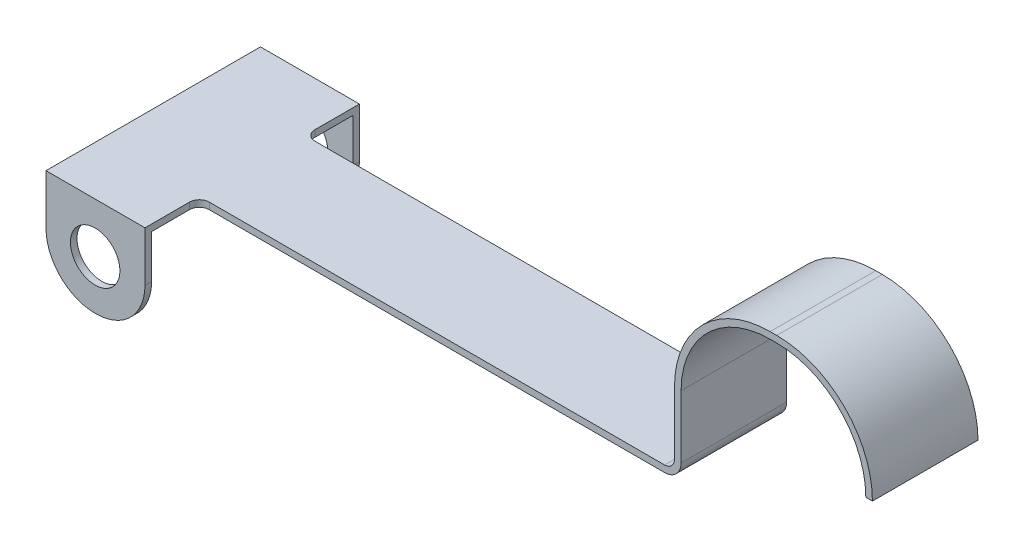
from build123d import *

# Parameters (mm, degrees)
ESQUISSE1_R             = 0.75
EXTRUSION1_DEPTH        = 6.5
ESQUISSE5_OUTSIDE_W     = 30.52
ESQUISSE5_OUTSIDE_H     = 13.62
ENL_V_MAT_EXTRU_3_DEPTH = 37.853900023
ESQUISSE6_W             = 6.1
ESQUISSE6_H             = 4.303194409
ENL_V_MAT_EXTRU_4_DEPTH = 28.51980229


with BuildPart() as part:
    # Esquisse1 → Extrusion1 (new body)
    with BuildSketch(Plane.XY):
        with BuildLine():
            Line((-32.060287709, 7.643319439), (-18.260287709, 7.643319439))
            ThreePointArc((-18.260287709, 7.643319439), (-17.906734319, 7.789766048), (-17.760287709, 8.143319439))
            Line((-17.760287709, 8.143319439), (-17.760287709, 10.043319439))
            ThreePointArc((-17.760287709, 10.043319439), (-16.969476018, 11.952507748), (-15.060287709, 12.743319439))
            Line((-15.060287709, 12.743319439), (-14.860287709, 12.743319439))
            ThreePointArc((-14.860287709, 12.743319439), (-12.9510994, 11.952507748), (-12.160287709, 10.043319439))
            Line((-12.160287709, 10.043319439), (-11.960287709, 10.043319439))
            ThreePointArc((-11.960287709, 10.043319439), (-12.809678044, 12.093929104), (-14.860287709, 12.943319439))
            Line((-14.860287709, 12.943319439), (-15.060287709, 12.943319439))
            ThreePointArc((-15.060287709, 12.943319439), (-17.110897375, 12.093929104), (-17.960287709, 10.043319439))
            Line((-17.960287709, 10.043319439), (-17.960287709, 8.143319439))
            ThreePointArc((-17.960287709, 8.143319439), (-18.048155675, 7.931187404), (-18.260287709, 7.843319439))
            Line((-18.260287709, 7.843319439), (-32.360287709, 7.843319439))
            Line((-32.360287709, 7.843319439), (-35.360287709, 7.843319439))
            Line((-35.360287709, 7.843319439), (-35.360287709, 6.333319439))
            ThreePointArc((-35.360287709, 6.333319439), (-34.923876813, 5.279730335), (-33.870287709, 4.843319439))
            Line((-33.870287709, 4.843319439), (-33.850287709, 4.843319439))
            ThreePointArc((-33.850287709, 4.843319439), (-32.796698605, 5.279730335), (-32.360287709, 6.333319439))
            Line((-32.360287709, 6.333319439), (-32.360287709, 7.343319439))
            ThreePointArc((-32.360287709, 7.343319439), (-32.272419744, 7.555451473), (-32.060287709, 7.643319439))
        make_face()
        with Locations(Location((-33.870287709, 6.333319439, 0), (0, 0, 180))):
            Circle(ESQUISSE1_R, mode=Mode.SUBTRACT)
    extrude(amount=EXTRUSION1_DEPTH)

    # Esquisse5 outside → Enl_v. mat.-Extru.3 (cut, through all)
    with BuildSketch(Plane(origin=(0, 12.943319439, 0), x_dir=(-1, 0, 0), z_dir=(0, 1, 0))):
        with Locations((23.66, 3.25)):
            Rectangle(ESQUISSE5_OUTSIDE_W, ESQUISSE5_OUTSIDE_H)
        with BuildLine():
            Line((32.060287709, 4.85), (9.749389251, 4.85))
            Line((9.749389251, 4.85), (9.749389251, 1.65))
            Line((9.749389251, 1.65), (32.060287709, 1.65))
            ThreePointArc((32.060287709, 1.65), (32.272419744, 1.562132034), (32.360287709, 1.35))
            Line((32.360287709, 1.35), (32.360287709, -1.461376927))
            Line((32.360287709, -1.461376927), (36.255290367, -1.461376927))
            Line((36.255290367, -1.461376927), (36.255290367, 8.266852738))
            Line((36.255290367, 8.266852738), (32.360287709, 8.266852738))
            Line((32.360287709, 8.266852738), (32.360287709, 5.15))
            ThreePointArc((32.360287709, 5.15), (32.272419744, 4.937867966), (32.060287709, 4.85))
        make_face(mode=Mode.SUBTRACT)
    extrude(amount=-ENL_V_MAT_EXTRU_3_DEPTH, mode=Mode.SUBTRACT)

    # Esquisse6 → Enl_v. mat.-Extru.4 (cut, through all)
    with BuildSketch(Plane.ZY.offset(35.360287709)):
        with Locations((3.25, 5.491722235)):
            Rectangle(ESQUISSE6_W, ESQUISSE6_H)
    extrude(amount=-ENL_V_MAT_EXTRU_4_DEPTH, mode=Mode.SUBTRACT)


solid = part.part
